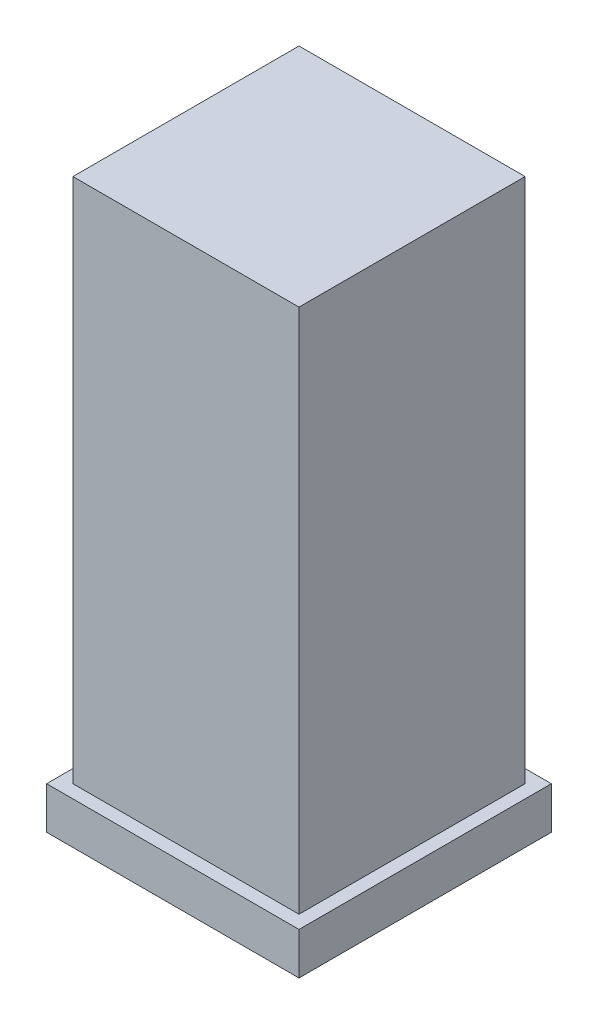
ISO-10303-21;
HEADER;
FILE_DESCRIPTION(('STEP AP214'),'2;1');
FILE_NAME('part.step','',(''),(''),'','','');
FILE_SCHEMA(('AUTOMOTIVE_DESIGN { 1 0 10303 214 1 1 1 1 }'));
ENDSEC;
DATA;
#1=APPLICATION_CONTEXT('core data for automotive mechanical design processes');
#2=APPLICATION_PROTOCOL_DEFINITION('international standard','automotive_design',2000,#1);
#3=PRODUCT_CONTEXT('',#1,'mechanical');
#4=PRODUCT('Part','Part','',(#3));
#5=PRODUCT_RELATED_PRODUCT_CATEGORY('part','',(#4));
#6=PRODUCT_DEFINITION_FORMATION('','',#4);
#7=PRODUCT_DEFINITION_CONTEXT('part definition',#1,'design');
#8=PRODUCT_DEFINITION('design','',#6,#7);
#9=PRODUCT_DEFINITION_SHAPE('','',#8);
#10=(LENGTH_UNIT() NAMED_UNIT(*) SI_UNIT(.MILLI.,.METRE.));
#11=(NAMED_UNIT(*) PLANE_ANGLE_UNIT() SI_UNIT($,.RADIAN.));
#12=(NAMED_UNIT(*) SI_UNIT($,.STERADIAN.) SOLID_ANGLE_UNIT());
#13=UNCERTAINTY_MEASURE_WITH_UNIT(LENGTH_MEASURE(1.E-05),#10,'distance_accuracy_value','');
#14=(GEOMETRIC_REPRESENTATION_CONTEXT(3) GLOBAL_UNCERTAINTY_ASSIGNED_CONTEXT((#13)) GLOBAL_UNIT_ASSIGNED_CONTEXT((#10,
#11,#12)) REPRESENTATION_CONTEXT('',''));
#15=CARTESIAN_POINT('',(0.,0.,0.));
#16=DIRECTION('',(0.,0.,1.));
#17=DIRECTION('',(1.,0.,0.));
#18=AXIS2_PLACEMENT_3D('',#15,#16,#17);
#19=CARTESIAN_POINT('',(-397.6,449.800035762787,1033.3));
#20=DIRECTION('',(0.,1.,0.));
#21=DIRECTION('',(0.,0.,1.));
#22=AXIS2_PLACEMENT_3D('',#19,#20,#21);
#23=PLANE('',#22);
#24=DIRECTION('',(1.,0.,0.));
#25=VECTOR('',#24,1.);
#26=CARTESIAN_POINT('',(-344.1,449.800035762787,954.8));
#27=LINE('',#26,#25);
#28=CARTESIAN_POINT('',(-344.1,449.800035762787,954.8));
#29=VERTEX_POINT('',#28);
#30=CARTESIAN_POINT('',(-301.1,449.800035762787,954.8));
#31=VERTEX_POINT('',#30);
#32=EDGE_CURVE('E11',#29,#31,#27,.T.);
#33=ORIENTED_EDGE('',*,*,#32,.T.);
#34=DIRECTION('',(0.,0.,-1.));
#35=VECTOR('',#34,1.);
#36=CARTESIAN_POINT('',(-301.1,449.800035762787,954.8));
#37=LINE('',#36,#35);
#38=CARTESIAN_POINT('',(-301.1,449.800035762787,911.8));
#39=VERTEX_POINT('',#38);
#40=EDGE_CURVE('E27',#31,#39,#37,.T.);
#41=ORIENTED_EDGE('',*,*,#40,.T.);
#42=DIRECTION('',(-1.,0.,0.));
#43=VECTOR('',#42,1.);
#44=CARTESIAN_POINT('',(-301.1,449.800035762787,911.8));
#45=LINE('',#44,#43);
#46=CARTESIAN_POINT('',(-344.1,449.800035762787,911.8));
#47=VERTEX_POINT('',#46);
#48=EDGE_CURVE('E159',#39,#47,#45,.T.);
#49=ORIENTED_EDGE('',*,*,#48,.T.);
#50=DIRECTION('',(0.,0.,1.));
#51=VECTOR('',#50,1.);
#52=CARTESIAN_POINT('',(-344.1,449.800035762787,911.8));
#53=LINE('',#52,#51);
#54=EDGE_CURVE('E156',#47,#29,#53,.T.);
#55=ORIENTED_EDGE('',*,*,#54,.T.);
#56=EDGE_LOOP('',(#33,#41,#49,#55));
#57=FACE_BOUND('',#56,.T.);
#58=ADVANCED_FACE('F17',(#57),#23,.T.);
#59=CARTESIAN_POINT('',(-301.1,349.800035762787,954.8));
#60=DIRECTION('',(1.,0.,0.));
#61=DIRECTION('',(0.,0.,-1.));
#62=AXIS2_PLACEMENT_3D('',#59,#60,#61);
#63=PLANE('',#62);
#64=DIRECTION('',(0.,0.,-1.));
#65=VECTOR('',#64,1.);
#66=CARTESIAN_POINT('',(-301.1,349.800035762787,954.8));
#67=LINE('',#66,#65);
#68=CARTESIAN_POINT('',(-301.1,349.800035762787,954.8));
#69=VERTEX_POINT('',#68);
#70=CARTESIAN_POINT('',(-301.1,349.800035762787,911.8));
#71=VERTEX_POINT('',#70);
#72=EDGE_CURVE('E160',#69,#71,#67,.T.);
#73=ORIENTED_EDGE('',*,*,#72,.T.);
#74=DIRECTION('',(0.,1.,0.));
#75=VECTOR('',#74,1.);
#76=CARTESIAN_POINT('',(-301.1,349.800035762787,911.8));
#77=LINE('',#76,#75);
#78=EDGE_CURVE('E163',#71,#39,#77,.T.);
#79=ORIENTED_EDGE('',*,*,#78,.T.);
#80=ORIENTED_EDGE('',*,*,#40,.F.);
#81=DIRECTION('',(0.,1.,0.));
#82=VECTOR('',#81,1.);
#83=CARTESIAN_POINT('',(-301.1,349.800035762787,954.8));
#84=LINE('',#83,#82);
#85=EDGE_CURVE('E123',#69,#31,#84,.T.);
#86=ORIENTED_EDGE('',*,*,#85,.F.);
#87=EDGE_LOOP('',(#73,#79,#80,#86));
#88=FACE_BOUND('',#87,.T.);
#89=ADVANCED_FACE('F228',(#88),#63,.T.);
#90=CARTESIAN_POINT('',(-301.1,349.800035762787,911.8));
#91=DIRECTION('',(0.,0.,-1.));
#92=DIRECTION('',(-1.,0.,0.));
#93=AXIS2_PLACEMENT_3D('',#90,#91,#92);
#94=PLANE('',#93);
#95=DIRECTION('',(-1.,0.,0.));
#96=VECTOR('',#95,1.);
#97=CARTESIAN_POINT('',(-301.1,349.800035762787,911.8));
#98=LINE('',#97,#96);
#99=CARTESIAN_POINT('',(-344.1,349.800035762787,911.8));
#100=VERTEX_POINT('',#99);
#101=EDGE_CURVE('E137',#71,#100,#98,.T.);
#102=ORIENTED_EDGE('',*,*,#101,.T.);
#103=DIRECTION('',(0.,1.,0.));
#104=VECTOR('',#103,1.);
#105=CARTESIAN_POINT('',(-344.1,349.800035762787,911.8));
#106=LINE('',#105,#104);
#107=EDGE_CURVE('E134',#100,#47,#106,.T.);
#108=ORIENTED_EDGE('',*,*,#107,.T.);
#109=ORIENTED_EDGE('',*,*,#48,.F.);
#110=ORIENTED_EDGE('',*,*,#78,.F.);
#111=EDGE_LOOP('',(#102,#108,#109,#110));
#112=FACE_BOUND('',#111,.T.);
#113=ADVANCED_FACE('F234',(#112),#94,.T.);
#114=CARTESIAN_POINT('',(-344.1,349.800035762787,911.8));
#115=DIRECTION('',(-1.,0.,0.));
#116=DIRECTION('',(0.,0.,1.));
#117=AXIS2_PLACEMENT_3D('',#114,#115,#116);
#118=PLANE('',#117);
#119=DIRECTION('',(0.,1.,0.));
#120=VECTOR('',#119,1.);
#121=CARTESIAN_POINT('',(-344.1,349.800035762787,954.8));
#122=LINE('',#121,#120);
#123=CARTESIAN_POINT('',(-344.1,349.800035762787,954.8));
#124=VERTEX_POINT('',#123);
#125=EDGE_CURVE('E138',#124,#29,#122,.T.);
#126=ORIENTED_EDGE('',*,*,#125,.T.);
#127=ORIENTED_EDGE('',*,*,#54,.F.);
#128=ORIENTED_EDGE('',*,*,#107,.F.);
#129=DIRECTION('',(0.,0.,1.));
#130=VECTOR('',#129,1.);
#131=CARTESIAN_POINT('',(-344.1,349.800035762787,911.8));
#132=LINE('',#131,#130);
#133=EDGE_CURVE('E177',#100,#124,#132,.T.);
#134=ORIENTED_EDGE('',*,*,#133,.T.);
#135=EDGE_LOOP('',(#126,#127,#128,#134));
#136=FACE_BOUND('',#135,.T.);
#137=ADVANCED_FACE('F239',(#136),#118,.T.);
#138=CARTESIAN_POINT('',(-396.35,341.800035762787,1032.05));
#139=DIRECTION('',(0.,-1.,0.));
#140=DIRECTION('',(0.,0.,-1.));
#141=AXIS2_PLACEMENT_3D('',#138,#139,#140);
#142=PLANE('',#141);
#143=DIRECTION('',(1.,0.,0.));
#144=VECTOR('',#143,1.);
#145=CARTESIAN_POINT('',(-370.725000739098,341.800035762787,955.8));
#146=LINE('',#145,#144);
#147=CARTESIAN_POINT('',(-345.100001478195,341.800035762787,955.8));
#148=VERTEX_POINT('',#147);
#149=CARTESIAN_POINT('',(-300.1,341.800035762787,955.8));
#150=VERTEX_POINT('',#149);
#151=EDGE_CURVE('E148',#148,#150,#146,.T.);
#152=ORIENTED_EDGE('',*,*,#151,.T.);
#153=DIRECTION('',(0.,0.,-1.));
#154=VECTOR('',#153,1.);
#155=CARTESIAN_POINT('',(-300.1,341.800035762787,993.925));
#156=LINE('',#155,#154);
#157=CARTESIAN_POINT('',(-300.1,341.800035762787,910.8));
#158=VERTEX_POINT('',#157);
#159=EDGE_CURVE('E129',#150,#158,#156,.T.);
#160=ORIENTED_EDGE('',*,*,#159,.T.);
#161=DIRECTION('',(-1.,0.,0.));
#162=VECTOR('',#161,1.);
#163=CARTESIAN_POINT('',(-348.225,341.800035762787,910.8));
#164=LINE('',#163,#162);
#165=CARTESIAN_POINT('',(-345.100000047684,341.800035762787,910.8));
#166=VERTEX_POINT('',#165);
#167=EDGE_CURVE('E113',#158,#166,#164,.T.);
#168=ORIENTED_EDGE('',*,*,#167,.T.);
#169=DIRECTION('',(-3.17891435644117E-08,0.,1.));
#170=VECTOR('',#169,1.);
#171=CARTESIAN_POINT('',(-345.100001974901,341.800035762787,971.425000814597));
#172=LINE('',#171,#170);
#173=EDGE_CURVE('E130',#166,#148,#172,.T.);
#174=ORIENTED_EDGE('',*,*,#173,.T.);
#175=EDGE_LOOP('',(#152,#160,#168,#174));
#176=FACE_BOUND('',#175,.T.);
#177=DIRECTION('',(0.,0.,-1.));
#178=VECTOR('',#177,1.);
#179=CARTESIAN_POINT('',(-346.6,341.800035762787,909.3));
#180=LINE('',#179,#178);
#181=CARTESIAN_POINT('',(-346.600001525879,341.800035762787,957.3));
#182=VERTEX_POINT('',#181);
#183=CARTESIAN_POINT('',(-346.6,341.800035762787,909.3));
#184=VERTEX_POINT('',#183);
#185=EDGE_CURVE('E152',#182,#184,#180,.T.);
#186=ORIENTED_EDGE('',*,*,#185,.T.);
#187=DIRECTION('',(1.,0.,0.));
#188=VECTOR('',#187,1.);
#189=CARTESIAN_POINT('',(-298.6,341.800035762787,909.3));
#190=LINE('',#189,#188);
#191=CARTESIAN_POINT('',(-298.6,341.800035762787,909.3));
#192=VERTEX_POINT('',#191);
#193=EDGE_CURVE('E149',#184,#192,#190,.T.);
#194=ORIENTED_EDGE('',*,*,#193,.T.);
#195=DIRECTION('',(0.,0.,1.));
#196=VECTOR('',#195,1.);
#197=CARTESIAN_POINT('',(-298.6,341.800035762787,957.3));
#198=LINE('',#197,#196);
#199=CARTESIAN_POINT('',(-298.6,341.800035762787,957.3));
#200=VERTEX_POINT('',#199);
#201=EDGE_CURVE('E143',#192,#200,#198,.T.);
#202=ORIENTED_EDGE('',*,*,#201,.T.);
#203=DIRECTION('',(-1.,0.,0.));
#204=VECTOR('',#203,1.);
#205=CARTESIAN_POINT('',(-346.6,341.800035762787,957.3));
#206=LINE('',#205,#204);
#207=EDGE_CURVE('E140',#200,#182,#206,.T.);
#208=ORIENTED_EDGE('',*,*,#207,.T.);
#209=EDGE_LOOP('',(#186,#194,#202,#208));
#210=FACE_BOUND('',#209,.T.);
#211=ADVANCED_FACE('F196',(#176,#210),#142,.T.);
#212=CARTESIAN_POINT('',(-344.1,349.800035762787,954.8));
#213=DIRECTION('',(0.,0.,1.));
#214=DIRECTION('',(1.,0.,0.));
#215=AXIS2_PLACEMENT_3D('',#212,#213,#214);
#216=PLANE('',#215);
#217=DIRECTION('',(1.,0.,0.));
#218=VECTOR('',#217,1.);
#219=CARTESIAN_POINT('',(-344.1,349.800035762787,954.8));
#220=LINE('',#219,#218);
#221=EDGE_CURVE('E126',#124,#69,#220,.T.);
#222=ORIENTED_EDGE('',*,*,#221,.T.);
#223=ORIENTED_EDGE('',*,*,#85,.T.);
#224=ORIENTED_EDGE('',*,*,#32,.F.);
#225=ORIENTED_EDGE('',*,*,#125,.F.);
#226=EDGE_LOOP('',(#222,#223,#224,#225));
#227=FACE_BOUND('',#226,.T.);
#228=ADVANCED_FACE('F246',(#227),#216,.T.);
#229=CARTESIAN_POINT('',(-346.6,349.800035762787,909.3));
#230=DIRECTION('',(0.,0.,-1.));
#231=DIRECTION('',(-1.,0.,0.));
#232=AXIS2_PLACEMENT_3D('',#229,#230,#231);
#233=PLANE('',#232);
#234=DIRECTION('',(-1.,0.,0.));
#235=VECTOR('',#234,1.);
#236=CARTESIAN_POINT('',(-298.6,349.800035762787,909.3));
#237=LINE('',#236,#235);
#238=CARTESIAN_POINT('',(-298.6,349.800035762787,909.3));
#239=VERTEX_POINT('',#238);
#240=CARTESIAN_POINT('',(-346.6,349.800035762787,909.3));
#241=VERTEX_POINT('',#240);
#242=EDGE_CURVE('E121',#239,#241,#237,.T.);
#243=ORIENTED_EDGE('',*,*,#242,.F.);
#244=DIRECTION('',(0.,-1.,0.));
#245=VECTOR('',#244,1.);
#246=CARTESIAN_POINT('',(-298.6,349.800035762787,909.3));
#247=LINE('',#246,#245);
#248=EDGE_CURVE('E127',#239,#192,#247,.T.);
#249=ORIENTED_EDGE('',*,*,#248,.T.);
#250=ORIENTED_EDGE('',*,*,#193,.F.);
#251=DIRECTION('',(0.,-1.,0.));
#252=VECTOR('',#251,1.);
#253=CARTESIAN_POINT('',(-346.6,349.800035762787,909.3));
#254=LINE('',#253,#252);
#255=EDGE_CURVE('E165',#241,#184,#254,.T.);
#256=ORIENTED_EDGE('',*,*,#255,.F.);
#257=EDGE_LOOP('',(#243,#249,#250,#256));
#258=FACE_BOUND('',#257,.T.);
#259=ADVANCED_FACE('F202',(#258),#233,.T.);
#260=CARTESIAN_POINT('',(-298.6,349.800035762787,909.3));
#261=DIRECTION('',(1.,0.,0.));
#262=DIRECTION('',(0.,0.,-1.));
#263=AXIS2_PLACEMENT_3D('',#260,#261,#262);
#264=PLANE('',#263);
#265=DIRECTION('',(0.,0.,-1.));
#266=VECTOR('',#265,1.);
#267=CARTESIAN_POINT('',(-298.6,349.800035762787,957.3));
#268=LINE('',#267,#266);
#269=CARTESIAN_POINT('',(-298.6,349.800035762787,957.3));
#270=VERTEX_POINT('',#269);
#271=EDGE_CURVE('E133',#270,#239,#268,.T.);
#272=ORIENTED_EDGE('',*,*,#271,.F.);
#273=DIRECTION('',(0.,-1.,0.));
#274=VECTOR('',#273,1.);
#275=CARTESIAN_POINT('',(-298.6,349.800035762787,957.3));
#276=LINE('',#275,#274);
#277=EDGE_CURVE('E21',#270,#200,#276,.T.);
#278=ORIENTED_EDGE('',*,*,#277,.T.);
#279=ORIENTED_EDGE('',*,*,#201,.F.);
#280=ORIENTED_EDGE('',*,*,#248,.F.);
#281=EDGE_LOOP('',(#272,#278,#279,#280));
#282=FACE_BOUND('',#281,.T.);
#283=ADVANCED_FACE('F208',(#282),#264,.T.);
#284=CARTESIAN_POINT('',(-298.6,349.800035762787,957.3));
#285=DIRECTION('',(0.,0.,1.));
#286=DIRECTION('',(1.,0.,0.));
#287=AXIS2_PLACEMENT_3D('',#284,#285,#286);
#288=PLANE('',#287);
#289=DIRECTION('',(1.,0.,0.));
#290=VECTOR('',#289,1.);
#291=CARTESIAN_POINT('',(-346.6,349.800035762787,957.3));
#292=LINE('',#291,#290);
#293=CARTESIAN_POINT('',(-346.600001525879,349.800035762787,957.3));
#294=VERTEX_POINT('',#293);
#295=EDGE_CURVE('E155',#294,#270,#292,.T.);
#296=ORIENTED_EDGE('',*,*,#295,.F.);
#297=DIRECTION('',(0.,-1.,0.));
#298=VECTOR('',#297,1.);
#299=CARTESIAN_POINT('',(-346.600001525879,349.800035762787,957.3));
#300=LINE('',#299,#298);
#301=EDGE_CURVE('E167',#294,#182,#300,.T.);
#302=ORIENTED_EDGE('',*,*,#301,.T.);
#303=ORIENTED_EDGE('',*,*,#207,.F.);
#304=ORIENTED_EDGE('',*,*,#277,.F.);
#305=EDGE_LOOP('',(#296,#302,#303,#304));
#306=FACE_BOUND('',#305,.T.);
#307=ADVANCED_FACE('F212',(#306),#288,.T.);
#308=CARTESIAN_POINT('',(-346.600001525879,349.800035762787,957.3));
#309=DIRECTION('',(-1.,0.,0.));
#310=DIRECTION('',(0.,0.,1.));
#311=AXIS2_PLACEMENT_3D('',#308,#309,#310);
#312=PLANE('',#311);
#313=ORIENTED_EDGE('',*,*,#185,.F.);
#314=ORIENTED_EDGE('',*,*,#301,.F.);
#315=DIRECTION('',(0.,0.,1.));
#316=VECTOR('',#315,1.);
#317=CARTESIAN_POINT('',(-346.600001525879,349.800035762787,994.675));
#318=LINE('',#317,#316);
#319=EDGE_CURVE('E168',#241,#294,#318,.T.);
#320=ORIENTED_EDGE('',*,*,#319,.F.);
#321=ORIENTED_EDGE('',*,*,#255,.T.);
#322=EDGE_LOOP('',(#313,#314,#320,#321));
#323=FACE_BOUND('',#322,.T.);
#324=ADVANCED_FACE('F214',(#323),#312,.T.);
#325=CARTESIAN_POINT('',(-396.35,349.800035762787,1032.05));
#326=DIRECTION('',(0.,1.,0.));
#327=DIRECTION('',(0.,0.,1.));
#328=AXIS2_PLACEMENT_3D('',#325,#326,#327);
#329=PLANE('',#328);
#330=ORIENTED_EDGE('',*,*,#133,.F.);
#331=ORIENTED_EDGE('',*,*,#101,.F.);
#332=ORIENTED_EDGE('',*,*,#72,.F.);
#333=ORIENTED_EDGE('',*,*,#221,.F.);
#334=EDGE_LOOP('',(#330,#331,#332,#333));
#335=FACE_BOUND('',#334,.T.);
#336=ORIENTED_EDGE('',*,*,#319,.T.);
#337=ORIENTED_EDGE('',*,*,#295,.T.);
#338=ORIENTED_EDGE('',*,*,#271,.T.);
#339=ORIENTED_EDGE('',*,*,#242,.T.);
#340=EDGE_LOOP('',(#336,#337,#338,#339));
#341=FACE_BOUND('',#340,.T.);
#342=ADVANCED_FACE('F216',(#335,#341),#329,.T.);
#343=CARTESIAN_POINT('',(-322.600000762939,342.300035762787,933.3));
#344=DIRECTION('',(0.,-1.,0.));
#345=DIRECTION('',(0.,0.,-1.));
#346=AXIS2_PLACEMENT_3D('',#343,#344,#345);
#347=PLANE('',#346);
#348=DIRECTION('',(0.,0.,-1.));
#349=VECTOR('',#348,1.);
#350=CARTESIAN_POINT('',(-300.1,342.300035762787,910.8));
#351=LINE('',#350,#349);
#352=CARTESIAN_POINT('',(-300.1,342.300035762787,955.8));
#353=VERTEX_POINT('',#352);
#354=CARTESIAN_POINT('',(-300.1,342.300035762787,910.8));
#355=VERTEX_POINT('',#354);
#356=EDGE_CURVE('E102',#353,#355,#351,.T.);
#357=ORIENTED_EDGE('',*,*,#356,.F.);
#358=DIRECTION('',(1.,0.,0.));
#359=VECTOR('',#358,1.);
#360=CARTESIAN_POINT('',(-300.1,342.300035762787,955.8));
#361=LINE('',#360,#359);
#362=CARTESIAN_POINT('',(-345.100001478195,342.300035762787,955.8));
#363=VERTEX_POINT('',#362);
#364=EDGE_CURVE('E144',#363,#353,#361,.T.);
#365=ORIENTED_EDGE('',*,*,#364,.F.);
#366=DIRECTION('',(-3.17891435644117E-08,0.,1.));
#367=VECTOR('',#366,1.);
#368=CARTESIAN_POINT('',(-345.100001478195,342.300035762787,955.8));
#369=LINE('',#368,#367);
#370=CARTESIAN_POINT('',(-345.100000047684,342.300035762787,910.8));
#371=VERTEX_POINT('',#370);
#372=EDGE_CURVE('E105',#371,#363,#369,.T.);
#373=ORIENTED_EDGE('',*,*,#372,.F.);
#374=DIRECTION('',(-1.,0.,0.));
#375=VECTOR('',#374,1.);
#376=CARTESIAN_POINT('',(-345.100000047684,342.300035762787,910.8));
#377=LINE('',#376,#375);
#378=EDGE_CURVE('E97',#355,#371,#377,.T.);
#379=ORIENTED_EDGE('',*,*,#378,.F.);
#380=EDGE_LOOP('',(#357,#365,#373,#379));
#381=FACE_BOUND('',#380,.T.);
#382=ADVANCED_FACE('F99',(#381),#347,.T.);
#383=CARTESIAN_POINT('',(-300.1,341.800035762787,955.8));
#384=DIRECTION('',(-1.,0.,0.));
#385=DIRECTION('',(0.,0.,1.));
#386=AXIS2_PLACEMENT_3D('',#383,#384,#385);
#387=PLANE('',#386);
#388=ORIENTED_EDGE('',*,*,#159,.F.);
#389=DIRECTION('',(0.,1.,0.));
#390=VECTOR('',#389,1.);
#391=CARTESIAN_POINT('',(-300.1,341.800035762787,955.8));
#392=LINE('',#391,#390);
#393=EDGE_CURVE('E119',#150,#353,#392,.T.);
#394=ORIENTED_EDGE('',*,*,#393,.T.);
#395=ORIENTED_EDGE('',*,*,#356,.T.);
#396=DIRECTION('',(0.,1.,0.));
#397=VECTOR('',#396,1.);
#398=CARTESIAN_POINT('',(-300.1,341.800035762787,910.8));
#399=LINE('',#398,#397);
#400=EDGE_CURVE('E107',#158,#355,#399,.T.);
#401=ORIENTED_EDGE('',*,*,#400,.F.);
#402=EDGE_LOOP('',(#388,#394,#395,#401));
#403=FACE_BOUND('',#402,.T.);
#404=ADVANCED_FACE('F117',(#403),#387,.T.);
#405=CARTESIAN_POINT('',(-300.1,341.800035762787,910.8));
#406=DIRECTION('',(0.,0.,1.));
#407=DIRECTION('',(1.,0.,0.));
#408=AXIS2_PLACEMENT_3D('',#405,#406,#407);
#409=PLANE('',#408);
#410=ORIENTED_EDGE('',*,*,#167,.F.);
#411=ORIENTED_EDGE('',*,*,#400,.T.);
#412=ORIENTED_EDGE('',*,*,#378,.T.);
#413=DIRECTION('',(0.,1.,0.));
#414=VECTOR('',#413,1.);
#415=CARTESIAN_POINT('',(-345.100000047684,341.800035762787,910.8));
#416=LINE('',#415,#414);
#417=EDGE_CURVE('E108',#166,#371,#416,.T.);
#418=ORIENTED_EDGE('',*,*,#417,.F.);
#419=EDGE_LOOP('',(#410,#411,#412,#418));
#420=FACE_BOUND('',#419,.T.);
#421=ADVANCED_FACE('F111',(#420),#409,.T.);
#422=CARTESIAN_POINT('',(-345.100000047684,341.800035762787,910.8));
#423=DIRECTION('',(1.,0.,3.17891435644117E-08));
#424=DIRECTION('',(3.17891435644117E-08,0.,-1.));
#425=AXIS2_PLACEMENT_3D('',#422,#423,#424);
#426=PLANE('',#425);
#427=ORIENTED_EDGE('',*,*,#173,.F.);
#428=ORIENTED_EDGE('',*,*,#417,.T.);
#429=ORIENTED_EDGE('',*,*,#372,.T.);
#430=DIRECTION('',(0.,1.,0.));
#431=VECTOR('',#430,1.);
#432=CARTESIAN_POINT('',(-345.100001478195,341.800035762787,955.8));
#433=LINE('',#432,#431);
#434=EDGE_CURVE('E146',#148,#363,#433,.T.);
#435=ORIENTED_EDGE('',*,*,#434,.F.);
#436=EDGE_LOOP('',(#427,#428,#429,#435));
#437=FACE_BOUND('',#436,.T.);
#438=ADVANCED_FACE('F288',(#437),#426,.T.);
#439=CARTESIAN_POINT('',(-345.100001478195,341.800035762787,955.8));
#440=DIRECTION('',(0.,0.,-1.));
#441=DIRECTION('',(-1.,0.,0.));
#442=AXIS2_PLACEMENT_3D('',#439,#440,#441);
#443=PLANE('',#442);
#444=ORIENTED_EDGE('',*,*,#151,.F.);
#445=ORIENTED_EDGE('',*,*,#434,.T.);
#446=ORIENTED_EDGE('',*,*,#364,.T.);
#447=ORIENTED_EDGE('',*,*,#393,.F.);
#448=EDGE_LOOP('',(#444,#445,#446,#447));
#449=FACE_BOUND('',#448,.T.);
#450=ADVANCED_FACE('F19',(#449),#443,.T.);
#451=CLOSED_SHELL('',(#58,#89,#113,#137,#211,#228,#259,#283,#307,#324,#342,#382,#404,#421,#438,#450));
#452=MANIFOLD_SOLID_BREP('B1',#451);
#453=ADVANCED_BREP_SHAPE_REPRESENTATION('',(#18,#452),#14);
#454=SHAPE_DEFINITION_REPRESENTATION(#9,#453);
ENDSEC;
END-ISO-10303-21;
